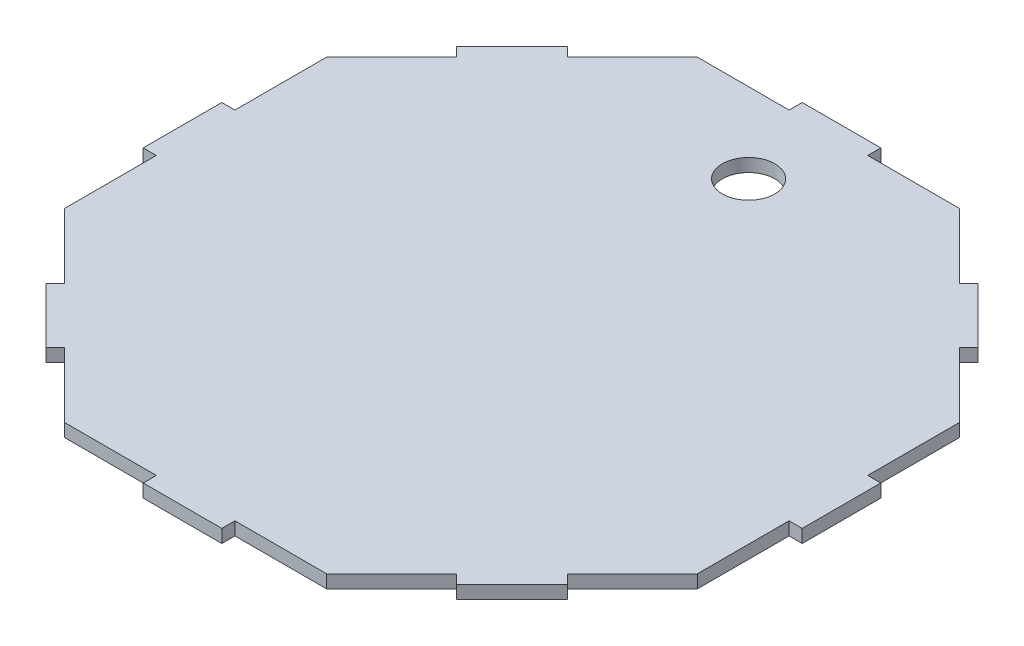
from build123d import *

# Parameters (mm, degrees)
CROQUIS1_R              = 10
SALIENTE_EXTRUIR1_DEPTH = 5


with BuildPart() as part:
    # Croquis1 → Saliente-Extruir1 (new body)
    with BuildSketch(Plane(origin=(0, 0, 0), x_dir=(1, 0, 0), z_dir=(0, 1, 0))):
        Polygon((-30.908981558, -85.661724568), (-30.908981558, -50.661724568), (-35.908981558, -50.661724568), (-35.908981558, -20.661724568), (-30.908981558, -20.661724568), (-30.908981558, 14.338275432), (-6.160244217, 39.087012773), (-9.695778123, 42.622546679), (11.517425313, 63.835750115), (15.052959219, 60.300216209), (39.80169656, 85.04895355), (74.80169656, 85.04895355), (74.80169656, 90.04895355), (104.80169656, 90.04895355), (104.80169656, 85.04895355), (139.80169656, 85.04895355), (164.550433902, 60.300216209), (168.085967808, 63.835750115), (189.299171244, 42.622546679), (185.763637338, 39.087012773), (210.512374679, 14.338275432), (210.512374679, -20.661724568), (215.512374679, -20.661724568), (215.512374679, -50.661724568), (210.512374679, -50.661724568), (210.512374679, -85.661724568), (185.763637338, -110.41046191), (189.299171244, -113.945995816), (168.085967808, -135.159199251), (164.550433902, -131.623665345), (139.80169656, -156.372402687), (104.80169656, -156.372402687), (104.80169656, -161.372402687), (74.80169656, -161.372402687), (74.80169656, -156.372402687), (39.80169656, -156.372402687), (15.052959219, -131.623665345), (11.517425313, -135.159199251), (-9.695778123, -113.945995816), (-6.160244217, -110.41046191), align=None)
        with Locations(Location((89.80169656, 54.599222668, 0), (0, 0, 270))):
            Circle(CROQUIS1_R, mode=Mode.SUBTRACT)
    extrude(amount=SALIENTE_EXTRUIR1_DEPTH)


solid = part.part
